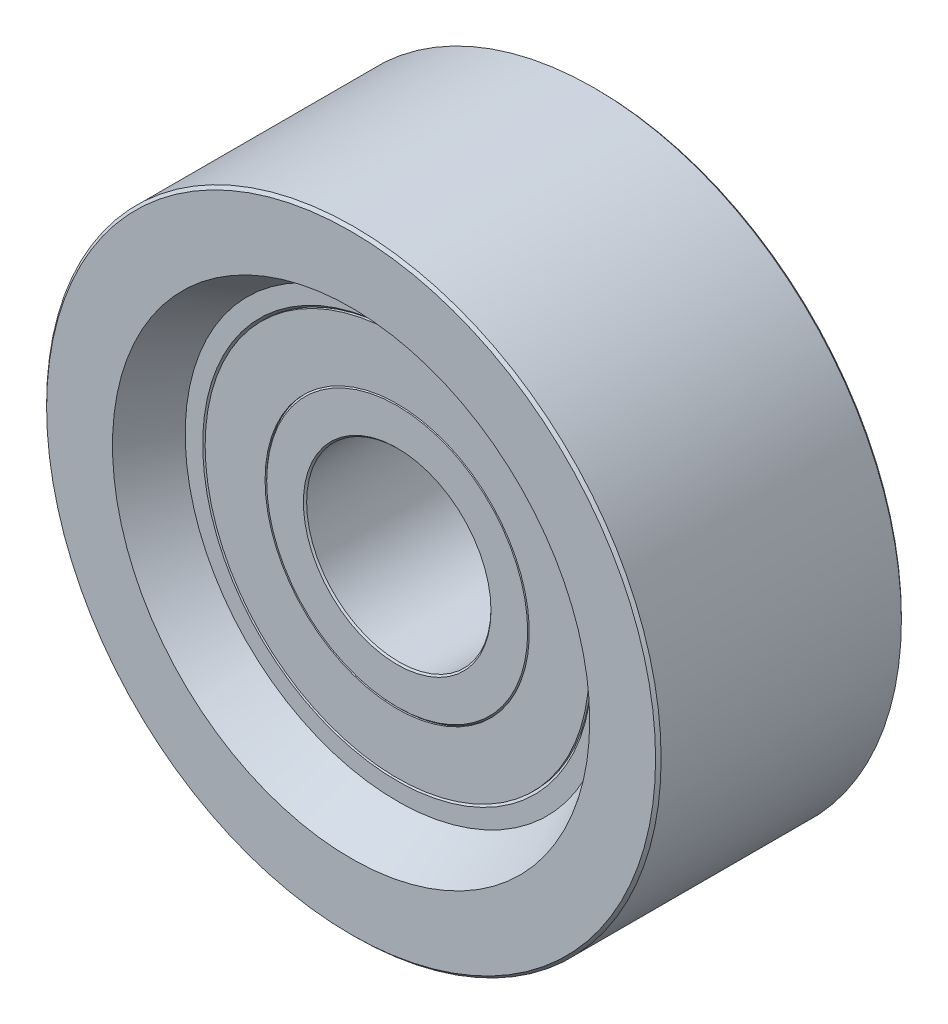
ISO-10303-21;
HEADER;
FILE_DESCRIPTION(('STEP AP214'),'2;1');
FILE_NAME('part.step','',(''),(''),'','','');
FILE_SCHEMA(('AUTOMOTIVE_DESIGN { 1 0 10303 214 1 1 1 1 }'));
ENDSEC;
DATA;
#1=APPLICATION_CONTEXT('core data for automotive mechanical design processes');
#2=APPLICATION_PROTOCOL_DEFINITION('international standard','automotive_design',2000,#1);
#3=PRODUCT_CONTEXT('',#1,'mechanical');
#4=PRODUCT('Part','Part','',(#3));
#5=PRODUCT_RELATED_PRODUCT_CATEGORY('part','',(#4));
#6=PRODUCT_DEFINITION_FORMATION('','',#4);
#7=PRODUCT_DEFINITION_CONTEXT('part definition',#1,'design');
#8=PRODUCT_DEFINITION('design','',#6,#7);
#9=PRODUCT_DEFINITION_SHAPE('','',#8);
#10=(LENGTH_UNIT() NAMED_UNIT(*) SI_UNIT(.MILLI.,.METRE.));
#11=(NAMED_UNIT(*) PLANE_ANGLE_UNIT() SI_UNIT($,.RADIAN.));
#12=(NAMED_UNIT(*) SI_UNIT($,.STERADIAN.) SOLID_ANGLE_UNIT());
#13=UNCERTAINTY_MEASURE_WITH_UNIT(LENGTH_MEASURE(1.E-05),#10,'distance_accuracy_value','');
#14=(GEOMETRIC_REPRESENTATION_CONTEXT(3) GLOBAL_UNCERTAINTY_ASSIGNED_CONTEXT((#13)) GLOBAL_UNIT_ASSIGNED_CONTEXT((#10,
#11,#12)) REPRESENTATION_CONTEXT('',''));
#15=CARTESIAN_POINT('',(0.,0.,0.));
#16=DIRECTION('',(0.,0.,1.));
#17=DIRECTION('',(1.,0.,0.));
#18=AXIS2_PLACEMENT_3D('',#15,#16,#17);
#19=CARTESIAN_POINT('',(0.,6.615,-2.5));
#20=DIRECTION('',(0.,0.,-1.));
#21=DIRECTION('',(-1.,0.,0.));
#22=AXIS2_PLACEMENT_3D('',#19,#20,#21);
#23=PLANE('',#22);
#24=CARTESIAN_POINT('',(0.,0.,-2.50000000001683));
#25=DIRECTION('',(0.,0.,-1.));
#26=DIRECTION('',(-1.,0.,0.));
#27=AXIS2_PLACEMENT_3D('',#24,#25,#26);
#28=CIRCLE('',#27,6.32999999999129);
#29=CARTESIAN_POINT('',(-6.32999999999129,0.,-2.50000000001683));
#30=VERTEX_POINT('',#29);
#31=EDGE_CURVE('E55',#30,#30,#28,.F.);
#32=ORIENTED_EDGE('',*,*,#31,.T.);
#33=EDGE_LOOP('',(#32));
#34=FACE_BOUND('',#33,.T.);
#35=CARTESIAN_POINT('',(0.,0.,-2.5));
#36=DIRECTION('',(0.,0.,-1.));
#37=DIRECTION('',(-1.,0.,0.));
#38=AXIS2_PLACEMENT_3D('',#35,#36,#37);
#39=CIRCLE('',#38,6.9);
#40=CARTESIAN_POINT('',(-6.9,0.,-2.5));
#41=VERTEX_POINT('',#40);
#42=EDGE_CURVE('E49',#41,#41,#39,.T.);
#43=ORIENTED_EDGE('',*,*,#42,.T.);
#44=EDGE_LOOP('',(#43));
#45=FACE_BOUND('',#44,.T.);
#46=ADVANCED_FACE('F12',(#34,#45),#23,.T.);
#47=CARTESIAN_POINT('',(0.,0.,-2.50000000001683));
#48=DIRECTION('',(0.,0.,-1.));
#49=DIRECTION('',(-1.,0.,0.));
#50=AXIS2_PLACEMENT_3D('',#47,#48,#49);
#51=CONICAL_SURFACE('',#50,6.32999999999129,0.785398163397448);
#52=ORIENTED_EDGE('',*,*,#31,.F.);
#53=EDGE_LOOP('',(#52));
#54=FACE_BOUND('',#53,.T.);
#55=CARTESIAN_POINT('',(0.,0.,-2.41999999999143));
#56=DIRECTION('',(0.,0.,-1.));
#57=DIRECTION('',(0.,1.,0.));
#58=AXIS2_PLACEMENT_3D('',#55,#56,#57);
#59=CIRCLE('',#58,6.24999999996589);
#60=CARTESIAN_POINT('',(0.,6.24999999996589,-2.41999999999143));
#61=VERTEX_POINT('',#60);
#62=EDGE_CURVE('E8',#61,#61,#59,.T.);
#63=ORIENTED_EDGE('',*,*,#62,.F.);
#64=EDGE_LOOP('',(#63));
#65=FACE_BOUND('',#64,.T.);
#66=ADVANCED_FACE('F93',(#54,#65),#51,.F.);
#67=CARTESIAN_POINT('',(0.,0.,-4.));
#68=DIRECTION('',(0.,0.,-1.));
#69=DIRECTION('',(-1.,0.,0.));
#70=AXIS2_PLACEMENT_3D('',#67,#68,#69);
#71=CONICAL_SURFACE('',#70,7.76602540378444,0.523598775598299);
#72=CARTESIAN_POINT('',(0.,0.,-4.));
#73=DIRECTION('',(0.,0.,-1.));
#74=DIRECTION('',(-1.,0.,0.));
#75=AXIS2_PLACEMENT_3D('',#72,#73,#74);
#76=CIRCLE('',#75,7.76602540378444);
#77=CARTESIAN_POINT('',(-7.76602540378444,0.,-4.));
#78=VERTEX_POINT('',#77);
#79=EDGE_CURVE('E43',#78,#78,#76,.F.);
#80=ORIENTED_EDGE('',*,*,#79,.F.);
#81=EDGE_LOOP('',(#80));
#82=FACE_BOUND('',#81,.T.);
#83=ORIENTED_EDGE('',*,*,#42,.F.);
#84=EDGE_LOOP('',(#83));
#85=FACE_BOUND('',#84,.T.);
#86=ADVANCED_FACE('F96',(#82,#85),#71,.F.);
#87=CARTESIAN_POINT('',(0.,8.83796765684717,-4.));
#88=DIRECTION('',(0.,0.,-1.));
#89=DIRECTION('',(-1.,0.,0.));
#90=AXIS2_PLACEMENT_3D('',#87,#88,#89);
#91=PLANE('',#90);
#92=ORIENTED_EDGE('',*,*,#79,.T.);
#93=EDGE_LOOP('',(#92));
#94=FACE_BOUND('',#93,.T.);
#95=CARTESIAN_POINT('',(0.,0.,-4.));
#96=DIRECTION('',(0.,0.,1.));
#97=DIRECTION('',(1.,0.,0.));
#98=AXIS2_PLACEMENT_3D('',#95,#96,#97);
#99=CIRCLE('',#98,9.90990990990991);
#100=CARTESIAN_POINT('',(9.90990990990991,0.,-4.));
#101=VERTEX_POINT('',#100);
#102=EDGE_CURVE('E36',#101,#101,#99,.T.);
#103=ORIENTED_EDGE('',*,*,#102,.F.);
#104=EDGE_LOOP('',(#103));
#105=FACE_BOUND('',#104,.T.);
#106=ADVANCED_FACE('F114',(#94,#105),#91,.T.);
#107=CARTESIAN_POINT('',(0.,0.,-3.90990990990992));
#108=DIRECTION('',(0.,0.,1.));
#109=DIRECTION('',(1.,0.,0.));
#110=AXIS2_PLACEMENT_3D('',#107,#108,#109);
#111=CONICAL_SURFACE('',#110,10.,0.785398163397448);
#112=ORIENTED_EDGE('',*,*,#102,.T.);
#113=EDGE_LOOP('',(#112));
#114=FACE_BOUND('',#113,.T.);
#115=CARTESIAN_POINT('',(0.,0.,-3.90990990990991));
#116=DIRECTION('',(0.,0.,-1.));
#117=DIRECTION('',(-1.,0.,0.));
#118=AXIS2_PLACEMENT_3D('',#115,#116,#117);
#119=CIRCLE('',#118,10.);
#120=CARTESIAN_POINT('',(-10.,0.,-3.90990990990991));
#121=VERTEX_POINT('',#120);
#122=EDGE_CURVE('E29',#121,#121,#119,.F.);
#123=ORIENTED_EDGE('',*,*,#122,.F.);
#124=EDGE_LOOP('',(#123));
#125=FACE_BOUND('',#124,.T.);
#126=ADVANCED_FACE('F122',(#114,#125),#111,.T.);
#127=CARTESIAN_POINT('',(0.,0.,0.));
#128=DIRECTION('',(0.,0.,-1.));
#129=DIRECTION('',(-1.,0.,0.));
#130=AXIS2_PLACEMENT_3D('',#127,#128,#129);
#131=CYLINDRICAL_SURFACE('',#130,10.);
#132=CARTESIAN_POINT('',(0.,0.,3.90990990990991));
#133=DIRECTION('',(0.,0.,-1.));
#134=DIRECTION('',(-1.,0.,0.));
#135=AXIS2_PLACEMENT_3D('',#132,#133,#134);
#136=CIRCLE('',#135,10.);
#137=CARTESIAN_POINT('',(-10.,0.,3.90990990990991));
#138=VERTEX_POINT('',#137);
#139=EDGE_CURVE('E39',#138,#138,#136,.T.);
#140=ORIENTED_EDGE('',*,*,#139,.T.);
#141=EDGE_LOOP('',(#140));
#142=FACE_BOUND('',#141,.T.);
#143=ORIENTED_EDGE('',*,*,#122,.T.);
#144=EDGE_LOOP('',(#143));
#145=FACE_BOUND('',#144,.T.);
#146=ADVANCED_FACE('F126',(#142,#145),#131,.T.);
#147=CARTESIAN_POINT('',(0.,0.,3.90990990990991));
#148=DIRECTION('',(0.,0.,-1.));
#149=DIRECTION('',(-1.,0.,0.));
#150=AXIS2_PLACEMENT_3D('',#147,#148,#149);
#151=CONICAL_SURFACE('',#150,10.,0.78539816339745);
#152=CARTESIAN_POINT('',(0.,0.,4.));
#153=DIRECTION('',(0.,0.,-1.));
#154=DIRECTION('',(-1.,0.,0.));
#155=AXIS2_PLACEMENT_3D('',#152,#153,#154);
#156=CIRCLE('',#155,9.90990990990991);
#157=CARTESIAN_POINT('',(-9.90990990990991,0.,4.));
#158=VERTEX_POINT('',#157);
#159=EDGE_CURVE('E40',#158,#158,#156,.T.);
#160=ORIENTED_EDGE('',*,*,#159,.T.);
#161=EDGE_LOOP('',(#160));
#162=FACE_BOUND('',#161,.T.);
#163=ORIENTED_EDGE('',*,*,#139,.F.);
#164=EDGE_LOOP('',(#163));
#165=FACE_BOUND('',#164,.T.);
#166=ADVANCED_FACE('F118',(#162,#165),#151,.T.);
#167=CARTESIAN_POINT('',(0.,8.83796765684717,4.));
#168=DIRECTION('',(0.,0.,1.));
#169=DIRECTION('',(1.,0.,0.));
#170=AXIS2_PLACEMENT_3D('',#167,#168,#169);
#171=PLANE('',#170);
#172=ORIENTED_EDGE('',*,*,#159,.F.);
#173=EDGE_LOOP('',(#172));
#174=FACE_BOUND('',#173,.T.);
#175=CARTESIAN_POINT('',(0.,0.,4.));
#176=DIRECTION('',(0.,0.,1.));
#177=DIRECTION('',(1.,0.,0.));
#178=AXIS2_PLACEMENT_3D('',#175,#176,#177);
#179=CIRCLE('',#178,7.76602540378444);
#180=CARTESIAN_POINT('',(7.76602540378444,0.,4.));
#181=VERTEX_POINT('',#180);
#182=EDGE_CURVE('E46',#181,#181,#179,.F.);
#183=ORIENTED_EDGE('',*,*,#182,.T.);
#184=EDGE_LOOP('',(#183));
#185=FACE_BOUND('',#184,.T.);
#186=ADVANCED_FACE('F110',(#174,#185),#171,.T.);
#187=CARTESIAN_POINT('',(0.,0.,4.));
#188=DIRECTION('',(0.,0.,1.));
#189=DIRECTION('',(1.,0.,0.));
#190=AXIS2_PLACEMENT_3D('',#187,#188,#189);
#191=CONICAL_SURFACE('',#190,7.76602540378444,0.523598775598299);
#192=CARTESIAN_POINT('',(0.,0.,2.5));
#193=DIRECTION('',(0.,0.,1.));
#194=DIRECTION('',(1.,0.,0.));
#195=AXIS2_PLACEMENT_3D('',#192,#193,#194);
#196=CIRCLE('',#195,6.9);
#197=CARTESIAN_POINT('',(6.9,0.,2.5));
#198=VERTEX_POINT('',#197);
#199=EDGE_CURVE('E52',#198,#198,#196,.T.);
#200=ORIENTED_EDGE('',*,*,#199,.F.);
#201=EDGE_LOOP('',(#200));
#202=FACE_BOUND('',#201,.T.);
#203=ORIENTED_EDGE('',*,*,#182,.F.);
#204=EDGE_LOOP('',(#203));
#205=FACE_BOUND('',#204,.T.);
#206=ADVANCED_FACE('F102',(#202,#205),#191,.F.);
#207=CARTESIAN_POINT('',(0.,6.615,2.5));
#208=DIRECTION('',(0.,0.,1.));
#209=DIRECTION('',(1.,0.,0.));
#210=AXIS2_PLACEMENT_3D('',#207,#208,#209);
#211=PLANE('',#210);
#212=ORIENTED_EDGE('',*,*,#199,.T.);
#213=EDGE_LOOP('',(#212));
#214=FACE_BOUND('',#213,.T.);
#215=CARTESIAN_POINT('',(0.,0.,2.50000000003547));
#216=DIRECTION('',(0.,0.,1.));
#217=DIRECTION('',(1.,0.,0.));
#218=AXIS2_PLACEMENT_3D('',#215,#216,#217);
#219=CIRCLE('',#218,6.32999999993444);
#220=CARTESIAN_POINT('',(6.32999999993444,0.,2.50000000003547));
#221=VERTEX_POINT('',#220);
#222=EDGE_CURVE('E34',#221,#221,#219,.F.);
#223=ORIENTED_EDGE('',*,*,#222,.T.);
#224=EDGE_LOOP('',(#223));
#225=FACE_BOUND('',#224,.T.);
#226=ADVANCED_FACE('F98',(#214,#225),#211,.T.);
#227=CARTESIAN_POINT('',(0.,0.,-2.44723926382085));
#228=DIRECTION('',(0.,0.,1.));
#229=DIRECTION('',(1.,0.,0.));
#230=AXIS2_PLACEMENT_3D('',#227,#228,#229);
#231=CONICAL_SURFACE('',#230,4.2999999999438,0.785398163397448);
#232=CARTESIAN_POINT('',(0.,0.,-2.44723926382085));
#233=DIRECTION('',(0.,0.,1.));
#234=DIRECTION('',(0.,1.,0.));
#235=AXIS2_PLACEMENT_3D('',#232,#233,#234);
#236=CIRCLE('',#235,4.2999999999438);
#237=CARTESIAN_POINT('',(0.,4.2999999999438,-2.44723926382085));
#238=VERTEX_POINT('',#237);
#239=EDGE_CURVE('E20',#238,#238,#236,.F.);
#240=ORIENTED_EDGE('',*,*,#239,.T.);
#241=EDGE_LOOP('',(#240));
#242=FACE_BOUND('',#241,.T.);
#243=CARTESIAN_POINT('',(0.,0.,-2.49999999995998));
#244=DIRECTION('',(0.,0.,1.));
#245=DIRECTION('',(1.,0.,0.));
#246=AXIS2_PLACEMENT_3D('',#243,#244,#245);
#247=CIRCLE('',#246,4.24723926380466);
#248=CARTESIAN_POINT('',(4.24723926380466,0.,-2.49999999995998));
#249=VERTEX_POINT('',#248);
#250=EDGE_CURVE('E194',#249,#249,#247,.F.);
#251=ORIENTED_EDGE('',*,*,#250,.F.);
#252=EDGE_LOOP('',(#251));
#253=FACE_BOUND('',#252,.T.);
#254=ADVANCED_FACE('F101',(#242,#253),#231,.T.);
#255=CARTESIAN_POINT('',(0.,3.65,-2.5));
#256=DIRECTION('',(0.,0.,-1.));
#257=DIRECTION('',(-1.,0.,0.));
#258=AXIS2_PLACEMENT_3D('',#255,#256,#257);
#259=PLANE('',#258);
#260=CARTESIAN_POINT('',(0.,0.,-2.49999999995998));
#261=DIRECTION('',(0.,0.,-1.));
#262=DIRECTION('',(-1.,0.,0.));
#263=AXIS2_PLACEMENT_3D('',#260,#261,#262);
#264=CIRCLE('',#263,3.05276073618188);
#265=CARTESIAN_POINT('',(-3.05276073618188,0.,-2.49999999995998));
#266=VERTEX_POINT('',#265);
#267=EDGE_CURVE('E183',#266,#266,#264,.F.);
#268=ORIENTED_EDGE('',*,*,#267,.T.);
#269=EDGE_LOOP('',(#268));
#270=FACE_BOUND('',#269,.T.);
#271=ORIENTED_EDGE('',*,*,#250,.T.);
#272=EDGE_LOOP('',(#271));
#273=FACE_BOUND('',#272,.T.);
#274=ADVANCED_FACE('F140',(#270,#273),#259,.T.);
#275=CARTESIAN_POINT('',(0.,0.,-2.49999999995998));
#276=DIRECTION('',(0.,0.,-1.));
#277=DIRECTION('',(-1.,0.,0.));
#278=AXIS2_PLACEMENT_3D('',#275,#276,#277);
#279=CONICAL_SURFACE('',#278,3.05276073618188,0.785398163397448);
#280=ORIENTED_EDGE('',*,*,#267,.F.);
#281=EDGE_LOOP('',(#280));
#282=FACE_BOUND('',#281,.T.);
#283=CARTESIAN_POINT('',(0.,0.,-2.44723926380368));
#284=DIRECTION('',(0.,0.,-1.));
#285=DIRECTION('',(-1.,0.,0.));
#286=AXIS2_PLACEMENT_3D('',#283,#284,#285);
#287=CIRCLE('',#286,3.);
#288=CARTESIAN_POINT('',(-3.,0.,-2.44723926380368));
#289=VERTEX_POINT('',#288);
#290=EDGE_CURVE('E175',#289,#289,#287,.F.);
#291=ORIENTED_EDGE('',*,*,#290,.T.);
#292=EDGE_LOOP('',(#291));
#293=FACE_BOUND('',#292,.T.);
#294=ADVANCED_FACE('F148',(#282,#293),#279,.F.);
#295=CARTESIAN_POINT('',(0.,0.,0.));
#296=DIRECTION('',(0.,0.,-1.));
#297=DIRECTION('',(-1.,0.,0.));
#298=AXIS2_PLACEMENT_3D('',#295,#296,#297);
#299=CYLINDRICAL_SURFACE('',#298,3.);
#300=ORIENTED_EDGE('',*,*,#290,.F.);
#301=EDGE_LOOP('',(#300));
#302=FACE_BOUND('',#301,.T.);
#303=CARTESIAN_POINT('',(0.,0.,2.44723926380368));
#304=DIRECTION('',(0.,0.,-1.));
#305=DIRECTION('',(-1.,0.,0.));
#306=AXIS2_PLACEMENT_3D('',#303,#304,#305);
#307=CIRCLE('',#306,3.);
#308=CARTESIAN_POINT('',(-3.,0.,2.44723926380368));
#309=VERTEX_POINT('',#308);
#310=EDGE_CURVE('E179',#309,#309,#307,.T.);
#311=ORIENTED_EDGE('',*,*,#310,.F.);
#312=EDGE_LOOP('',(#311));
#313=FACE_BOUND('',#312,.T.);
#314=ADVANCED_FACE('F152',(#302,#313),#299,.F.);
#315=CARTESIAN_POINT('',(0.,0.,2.49999999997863));
#316=DIRECTION('',(0.,0.,1.));
#317=DIRECTION('',(1.,0.,0.));
#318=AXIS2_PLACEMENT_3D('',#315,#316,#317);
#319=CONICAL_SURFACE('',#318,3.05276073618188,0.785398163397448);
#320=ORIENTED_EDGE('',*,*,#310,.T.);
#321=EDGE_LOOP('',(#320));
#322=FACE_BOUND('',#321,.T.);
#323=CARTESIAN_POINT('',(0.,0.,2.49999999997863));
#324=DIRECTION('',(0.,0.,1.));
#325=DIRECTION('',(1.,0.,0.));
#326=AXIS2_PLACEMENT_3D('',#323,#324,#325);
#327=CIRCLE('',#326,3.05276073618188);
#328=CARTESIAN_POINT('',(3.05276073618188,0.,2.49999999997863));
#329=VERTEX_POINT('',#328);
#330=EDGE_CURVE('E191',#329,#329,#327,.F.);
#331=ORIENTED_EDGE('',*,*,#330,.F.);
#332=EDGE_LOOP('',(#331));
#333=FACE_BOUND('',#332,.T.);
#334=ADVANCED_FACE('F144',(#322,#333),#319,.F.);
#335=CARTESIAN_POINT('',(0.,3.65,2.5));
#336=DIRECTION('',(0.,0.,1.));
#337=DIRECTION('',(1.,0.,0.));
#338=AXIS2_PLACEMENT_3D('',#335,#336,#337);
#339=PLANE('',#338);
#340=CARTESIAN_POINT('',(0.,0.,2.49999999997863));
#341=DIRECTION('',(0.,0.,-1.));
#342=DIRECTION('',(-1.,0.,0.));
#343=AXIS2_PLACEMENT_3D('',#340,#341,#342);
#344=CIRCLE('',#343,4.24723926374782);
#345=CARTESIAN_POINT('',(-4.24723926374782,0.,2.49999999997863));
#346=VERTEX_POINT('',#345);
#347=EDGE_CURVE('E188',#346,#346,#344,.F.);
#348=ORIENTED_EDGE('',*,*,#347,.T.);
#349=EDGE_LOOP('',(#348));
#350=FACE_BOUND('',#349,.T.);
#351=ORIENTED_EDGE('',*,*,#330,.T.);
#352=EDGE_LOOP('',(#351));
#353=FACE_BOUND('',#352,.T.);
#354=ADVANCED_FACE('F136',(#350,#353),#339,.T.);
#355=CARTESIAN_POINT('',(0.,0.,2.44723926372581));
#356=DIRECTION('',(0.,0.,-1.));
#357=DIRECTION('',(-1.,0.,0.));
#358=AXIS2_PLACEMENT_3D('',#355,#356,#357);
#359=CONICAL_SURFACE('',#358,4.30000000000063,0.785398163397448);
#360=ORIENTED_EDGE('',*,*,#347,.F.);
#361=EDGE_LOOP('',(#360));
#362=FACE_BOUND('',#361,.T.);
#363=CARTESIAN_POINT('',(0.,0.,2.44723926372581));
#364=DIRECTION('',(0.,0.,-1.));
#365=DIRECTION('',(0.,1.,0.));
#366=AXIS2_PLACEMENT_3D('',#363,#364,#365);
#367=CIRCLE('',#366,4.30000000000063);
#368=CARTESIAN_POINT('',(0.,4.30000000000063,2.44723926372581));
#369=VERTEX_POINT('',#368);
#370=EDGE_CURVE('E185',#369,#369,#367,.F.);
#371=ORIENTED_EDGE('',*,*,#370,.T.);
#372=EDGE_LOOP('',(#371));
#373=FACE_BOUND('',#372,.T.);
#374=ADVANCED_FACE('F77',(#362,#373),#359,.T.);
#375=CARTESIAN_POINT('',(0.,0.,2.25));
#376=DIRECTION('',(0.,0.,-1.));
#377=DIRECTION('',(-1.,0.,0.));
#378=AXIS2_PLACEMENT_3D('',#375,#376,#377);
#379=CYLINDRICAL_SURFACE('',#378,4.3);
#380=ORIENTED_EDGE('',*,*,#370,.F.);
#381=EDGE_LOOP('',(#380));
#382=FACE_BOUND('',#381,.T.);
#383=CARTESIAN_POINT('',(0.,0.,2.5));
#384=DIRECTION('',(0.,0.,-1.));
#385=DIRECTION('',(-1.,0.,0.));
#386=AXIS2_PLACEMENT_3D('',#383,#384,#385);
#387=CIRCLE('',#386,4.3);
#388=CARTESIAN_POINT('',(-4.3,0.,2.5));
#389=VERTEX_POINT('',#388);
#390=EDGE_CURVE('E35',#389,#389,#387,.T.);
#391=ORIENTED_EDGE('',*,*,#390,.F.);
#392=EDGE_LOOP('',(#391));
#393=FACE_BOUND('',#392,.T.);
#394=ADVANCED_FACE('F69',(#382,#393),#379,.F.);
#395=CARTESIAN_POINT('',(0.,5.275,2.5));
#396=DIRECTION('',(0.,0.,1.));
#397=DIRECTION('',(1.,0.,0.));
#398=AXIS2_PLACEMENT_3D('',#395,#396,#397);
#399=PLANE('',#398);
#400=CARTESIAN_POINT('',(0.,0.,2.5));
#401=DIRECTION('',(0.,0.,-1.));
#402=DIRECTION('',(-1.,0.,0.));
#403=AXIS2_PLACEMENT_3D('',#400,#401,#402);
#404=CIRCLE('',#403,6.25);
#405=CARTESIAN_POINT('',(-6.25,0.,2.5));
#406=VERTEX_POINT('',#405);
#407=EDGE_CURVE('E16',#406,#406,#404,.T.);
#408=ORIENTED_EDGE('',*,*,#407,.F.);
#409=EDGE_LOOP('',(#408));
#410=FACE_BOUND('',#409,.T.);
#411=ORIENTED_EDGE('',*,*,#390,.T.);
#412=EDGE_LOOP('',(#411));
#413=FACE_BOUND('',#412,.T.);
#414=ADVANCED_FACE('F14',(#410,#413),#399,.T.);
#415=CARTESIAN_POINT('',(0.,0.,2.25));
#416=DIRECTION('',(0.,0.,-1.));
#417=DIRECTION('',(-1.,0.,0.));
#418=AXIS2_PLACEMENT_3D('',#415,#416,#417);
#419=CYLINDRICAL_SURFACE('',#418,6.25);
#420=ORIENTED_EDGE('',*,*,#407,.T.);
#421=EDGE_LOOP('',(#420));
#422=FACE_BOUND('',#421,.T.);
#423=CARTESIAN_POINT('',(0.,0.,2.42000000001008));
#424=DIRECTION('',(0.,0.,1.));
#425=DIRECTION('',(0.,1.,0.));
#426=AXIS2_PLACEMENT_3D('',#423,#424,#425);
#427=CIRCLE('',#426,6.24999999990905);
#428=CARTESIAN_POINT('',(0.,6.24999999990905,2.42000000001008));
#429=VERTEX_POINT('',#428);
#430=EDGE_CURVE('E31',#429,#429,#427,.T.);
#431=ORIENTED_EDGE('',*,*,#430,.T.);
#432=EDGE_LOOP('',(#431));
#433=FACE_BOUND('',#432,.T.);
#434=ADVANCED_FACE('F65',(#422,#433),#419,.T.);
#435=CARTESIAN_POINT('',(0.,0.,2.50000000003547));
#436=DIRECTION('',(0.,0.,1.));
#437=DIRECTION('',(1.,0.,0.));
#438=AXIS2_PLACEMENT_3D('',#435,#436,#437);
#439=CONICAL_SURFACE('',#438,6.32999999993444,0.785398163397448);
#440=ORIENTED_EDGE('',*,*,#430,.F.);
#441=EDGE_LOOP('',(#440));
#442=FACE_BOUND('',#441,.T.);
#443=ORIENTED_EDGE('',*,*,#222,.F.);
#444=EDGE_LOOP('',(#443));
#445=FACE_BOUND('',#444,.T.);
#446=ADVANCED_FACE('F76',(#442,#445),#439,.F.);
#447=CARTESIAN_POINT('',(0.,0.,-2.25));
#448=DIRECTION('',(0.,0.,-1.));
#449=DIRECTION('',(-1.,0.,0.));
#450=AXIS2_PLACEMENT_3D('',#447,#448,#449);
#451=CYLINDRICAL_SURFACE('',#450,6.25);
#452=ORIENTED_EDGE('',*,*,#62,.T.);
#453=EDGE_LOOP('',(#452));
#454=FACE_BOUND('',#453,.T.);
#455=CARTESIAN_POINT('',(0.,0.,-2.5));
#456=DIRECTION('',(0.,0.,-1.));
#457=DIRECTION('',(-1.,0.,0.));
#458=AXIS2_PLACEMENT_3D('',#455,#456,#457);
#459=CIRCLE('',#458,6.25);
#460=CARTESIAN_POINT('',(-6.25,0.,-2.5));
#461=VERTEX_POINT('',#460);
#462=EDGE_CURVE('E173',#461,#461,#459,.T.);
#463=ORIENTED_EDGE('',*,*,#462,.F.);
#464=EDGE_LOOP('',(#463));
#465=FACE_BOUND('',#464,.T.);
#466=ADVANCED_FACE('F81',(#454,#465),#451,.T.);
#467=CARTESIAN_POINT('',(0.,0.,-2.25));
#468=DIRECTION('',(0.,0.,-1.));
#469=DIRECTION('',(-1.,0.,0.));
#470=AXIS2_PLACEMENT_3D('',#467,#468,#469);
#471=CYLINDRICAL_SURFACE('',#470,4.3);
#472=CARTESIAN_POINT('',(0.,0.,-2.5));
#473=DIRECTION('',(0.,0.,-1.));
#474=DIRECTION('',(-1.,0.,0.));
#475=AXIS2_PLACEMENT_3D('',#472,#473,#474);
#476=CIRCLE('',#475,4.3);
#477=CARTESIAN_POINT('',(-4.3,0.,-2.5));
#478=VERTEX_POINT('',#477);
#479=EDGE_CURVE('E25',#478,#478,#476,.F.);
#480=ORIENTED_EDGE('',*,*,#479,.F.);
#481=EDGE_LOOP('',(#480));
#482=FACE_BOUND('',#481,.T.);
#483=ORIENTED_EDGE('',*,*,#239,.F.);
#484=EDGE_LOOP('',(#483));
#485=FACE_BOUND('',#484,.T.);
#486=ADVANCED_FACE('F88',(#482,#485),#471,.F.);
#487=CARTESIAN_POINT('',(0.,5.275,-2.5));
#488=DIRECTION('',(0.,0.,-1.));
#489=DIRECTION('',(-1.,0.,0.));
#490=AXIS2_PLACEMENT_3D('',#487,#488,#489);
#491=PLANE('',#490);
#492=ORIENTED_EDGE('',*,*,#479,.T.);
#493=EDGE_LOOP('',(#492));
#494=FACE_BOUND('',#493,.T.);
#495=ORIENTED_EDGE('',*,*,#462,.T.);
#496=EDGE_LOOP('',(#495));
#497=FACE_BOUND('',#496,.T.);
#498=ADVANCED_FACE('F107',(#494,#497),#491,.T.);
#499=CLOSED_SHELL('',(#46,#66,#86,#106,#126,#146,#166,#186,#206,#226,#254,#274,#294,#314,#334,
#354,#374,#394,#414,#434,#446,#466,#486,#498));
#500=MANIFOLD_SOLID_BREP('B1',#499);
#501=ADVANCED_BREP_SHAPE_REPRESENTATION('',(#18,#500),#14);
#502=SHAPE_DEFINITION_REPRESENTATION(#9,#501);
ENDSEC;
END-ISO-10303-21;
